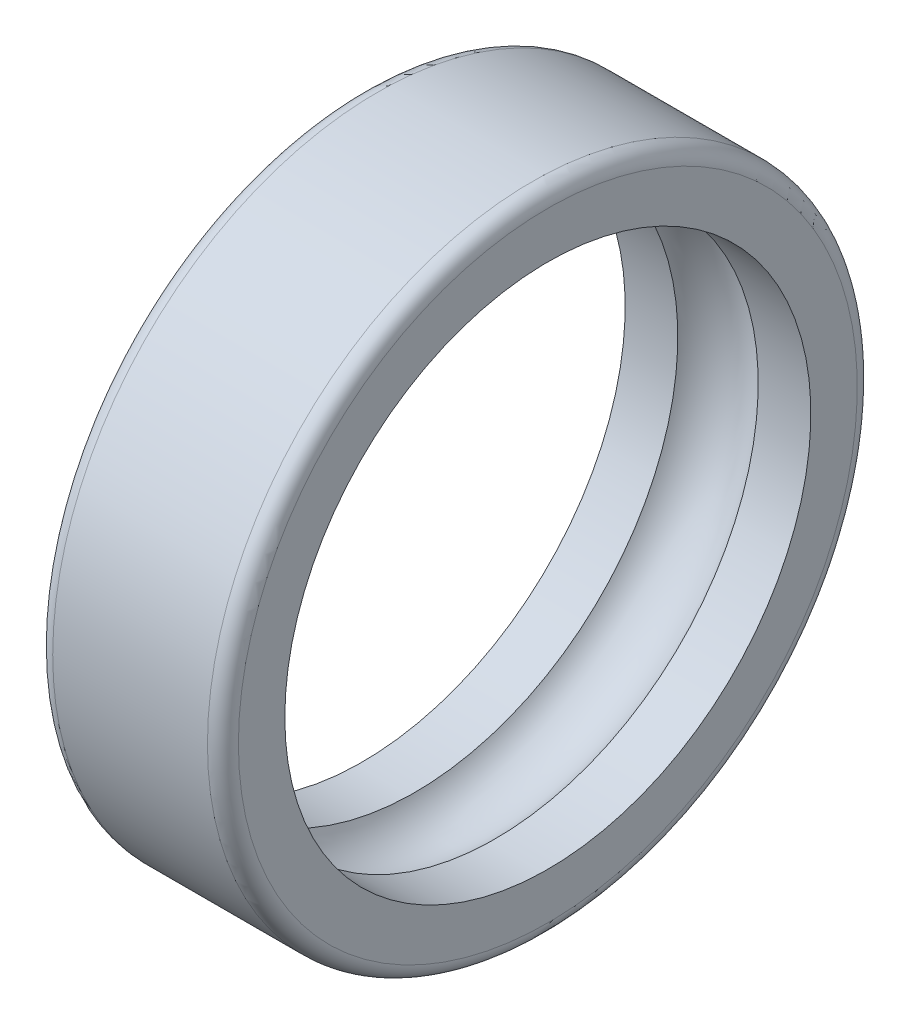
from build123d import *


with BuildPart() as part:
    # Esquisse1 → Base-R_volution (revolve)
    with BuildSketch(Plane.XY, mode=Mode.PRIVATE) as base_r_volution_sk:
        with BuildLine():
            Line((-7, 104.5), (-3.598076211, 104.5))
            ThreePointArc((-3.598076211, 104.5), (-1, 106), (1.598076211, 104.5))
            Line((1.598076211, 104.5), (5, 104.5))
            Line((5, 104.5), (5, 107.5))
            ThreePointArc((5, 107.5), (4.707106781, 108.207106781), (4, 108.5))
            Line((4, 108.5), (-6, 108.5))
            ThreePointArc((-6, 108.5), (-6.707106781, 108.207106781), (-7, 107.5))
            Line((-7, 107.5), (-7, 104.5))
        make_face()
    revolve(base_r_volution_sk.sketch.rotate(Axis((-11.189264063, 87.5, 0), (1, 0, 0)), 90), axis=Axis((-11.189264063, 87.5, 0), (1, 0, 0)))


solid = part.part
